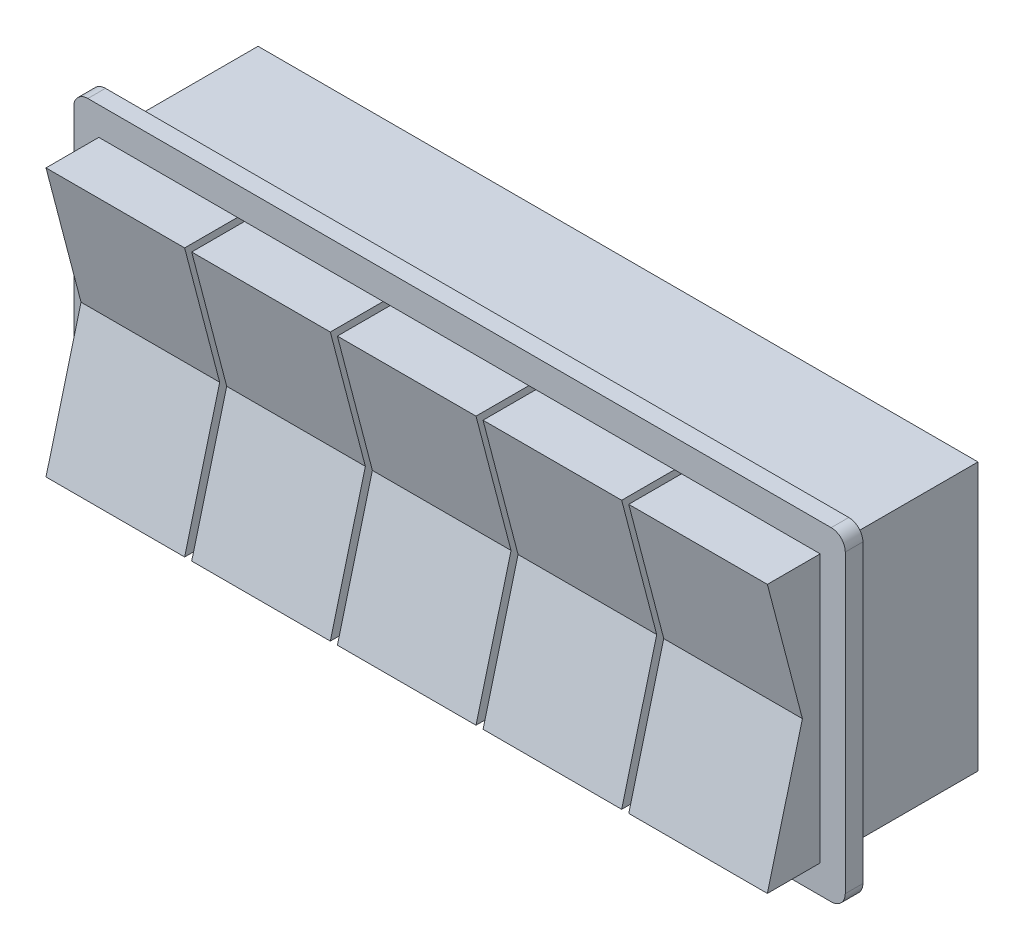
ISO-10303-21;
HEADER;
FILE_DESCRIPTION(('STEP AP214'),'2;1');
FILE_NAME('part.step','',(''),(''),'','','');
FILE_SCHEMA(('AUTOMOTIVE_DESIGN { 1 0 10303 214 1 1 1 1 }'));
ENDSEC;
DATA;
#1=APPLICATION_CONTEXT('core data for automotive mechanical design processes');
#2=APPLICATION_PROTOCOL_DEFINITION('international standard','automotive_design',2000,#1);
#3=PRODUCT_CONTEXT('',#1,'mechanical');
#4=PRODUCT('Part','Part','',(#3));
#5=PRODUCT_RELATED_PRODUCT_CATEGORY('part','',(#4));
#6=PRODUCT_DEFINITION_FORMATION('','',#4);
#7=PRODUCT_DEFINITION_CONTEXT('part definition',#1,'design');
#8=PRODUCT_DEFINITION('design','',#6,#7);
#9=PRODUCT_DEFINITION_SHAPE('','',#8);
#10=(LENGTH_UNIT() NAMED_UNIT(*) SI_UNIT(.MILLI.,.METRE.));
#11=(NAMED_UNIT(*) PLANE_ANGLE_UNIT() SI_UNIT($,.RADIAN.));
#12=(NAMED_UNIT(*) SI_UNIT($,.STERADIAN.) SOLID_ANGLE_UNIT());
#13=UNCERTAINTY_MEASURE_WITH_UNIT(LENGTH_MEASURE(1.E-05),#10,'distance_accuracy_value','');
#14=(GEOMETRIC_REPRESENTATION_CONTEXT(3) GLOBAL_UNCERTAINTY_ASSIGNED_CONTEXT((#13)) GLOBAL_UNIT_ASSIGNED_CONTEXT((#10,
#11,#12)) REPRESENTATION_CONTEXT('',''));
#15=CARTESIAN_POINT('',(0.,0.,0.));
#16=DIRECTION('',(0.,0.,1.));
#17=DIRECTION('',(1.,0.,0.));
#18=AXIS2_PLACEMENT_3D('',#15,#16,#17);
#19=CARTESIAN_POINT('',(-65.024,24.1299999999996,38.1));
#20=DIRECTION('',(0.,-1.,0.));
#21=DIRECTION('',(0.,0.,-1.));
#22=AXIS2_PLACEMENT_3D('',#19,#20,#21);
#23=PLANE('',#22);
#24=DIRECTION('',(-1.,0.,0.));
#25=VECTOR('',#24,1.);
#26=CARTESIAN_POINT('',(-65.024,24.1299999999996,25.4));
#27=LINE('',#26,#25);
#28=CARTESIAN_POINT('',(-40.0304,24.1299999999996,25.4));
#29=VERTEX_POINT('',#28);
#30=CARTESIAN_POINT('',(-65.024,24.1299999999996,25.4));
#31=VERTEX_POINT('',#30);
#32=EDGE_CURVE('E12',#29,#31,#27,.T.);
#33=ORIENTED_EDGE('',*,*,#32,.T.);
#34=DIRECTION('',(0.,0.,-1.));
#35=VECTOR('',#34,1.);
#36=CARTESIAN_POINT('',(-65.024,24.1299999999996,38.1));
#37=LINE('',#36,#35);
#38=CARTESIAN_POINT('',(-65.024,24.1299999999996,38.1));
#39=VERTEX_POINT('',#38);
#40=EDGE_CURVE('E116',#39,#31,#37,.T.);
#41=ORIENTED_EDGE('',*,*,#40,.F.);
#42=DIRECTION('',(-1.,0.,0.));
#43=VECTOR('',#42,1.);
#44=CARTESIAN_POINT('',(-65.024,24.1299999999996,38.1));
#45=LINE('',#44,#43);
#46=CARTESIAN_POINT('',(-40.0304,24.1299999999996,38.1));
#47=VERTEX_POINT('',#46);
#48=EDGE_CURVE('E59',#47,#39,#45,.T.);
#49=ORIENTED_EDGE('',*,*,#48,.F.);
#50=DIRECTION('',(0.,0.,-1.));
#51=VECTOR('',#50,1.);
#52=CARTESIAN_POINT('',(-40.0304,24.1299999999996,38.1));
#53=LINE('',#52,#51);
#54=EDGE_CURVE('E121',#47,#29,#53,.T.);
#55=ORIENTED_EDGE('',*,*,#54,.T.);
#56=EDGE_LOOP('',(#33,#41,#49,#55));
#57=FACE_BOUND('',#56,.T.);
#58=ADVANCED_FACE('F55',(#57),#23,.F.);
#59=CARTESIAN_POINT('',(-65.024,-24.1300000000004,38.1));
#60=DIRECTION('',(1.,0.,0.));
#61=DIRECTION('',(0.,0.,-1.));
#62=AXIS2_PLACEMENT_3D('',#59,#60,#61);
#63=PLANE('',#62);
#64=DIRECTION('',(0.,0.,-1.));
#65=VECTOR('',#64,1.);
#66=CARTESIAN_POINT('',(-65.024,-24.1300000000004,38.1));
#67=LINE('',#66,#65);
#68=CARTESIAN_POINT('',(-65.024,-24.1300000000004,38.1));
#69=VERTEX_POINT('',#68);
#70=CARTESIAN_POINT('',(-65.024,-24.1300000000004,25.4));
#71=VERTEX_POINT('',#70);
#72=EDGE_CURVE('E112',#69,#71,#67,.T.);
#73=ORIENTED_EDGE('',*,*,#72,.F.);
#74=DIRECTION('',(0.,-0.967409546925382,0.253216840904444));
#75=VECTOR('',#74,1.);
#76=CARTESIAN_POINT('',(-65.024,0.,31.7840375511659));
#77=LINE('',#76,#75);
#78=CARTESIAN_POINT('',(-65.024,0.,31.7840375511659));
#79=VERTEX_POINT('',#78);
#80=EDGE_CURVE('E98',#79,#69,#77,.T.);
#81=ORIENTED_EDGE('',*,*,#80,.F.);
#82=DIRECTION('',(0.,-0.96740954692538,-0.253216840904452));
#83=VECTOR('',#82,1.);
#84=CARTESIAN_POINT('',(-65.024,0.,31.7840375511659));
#85=LINE('',#84,#83);
#86=EDGE_CURVE('E109',#39,#79,#85,.T.);
#87=ORIENTED_EDGE('',*,*,#86,.F.);
#88=ORIENTED_EDGE('',*,*,#40,.T.);
#89=DIRECTION('',(0.,-1.,0.));
#90=VECTOR('',#89,1.);
#91=CARTESIAN_POINT('',(-65.024,-24.1300000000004,25.4));
#92=LINE('',#91,#90);
#93=EDGE_CURVE('E65',#31,#71,#92,.T.);
#94=ORIENTED_EDGE('',*,*,#93,.T.);
#95=EDGE_LOOP('',(#73,#81,#87,#88,#94));
#96=FACE_BOUND('',#95,.T.);
#97=ADVANCED_FACE('F113',(#96),#63,.F.);
#98=CARTESIAN_POINT('',(-65.024,-24.1300000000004,38.1));
#99=DIRECTION('',(0.,1.,0.));
#100=DIRECTION('',(0.,0.,1.));
#101=AXIS2_PLACEMENT_3D('',#98,#99,#100);
#102=PLANE('',#101);
#103=DIRECTION('',(1.,0.,0.));
#104=VECTOR('',#103,1.);
#105=CARTESIAN_POINT('',(-65.024,-24.1300000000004,25.4));
#106=LINE('',#105,#104);
#107=CARTESIAN_POINT('',(-40.0304,-24.1300000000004,25.4));
#108=VERTEX_POINT('',#107);
#109=EDGE_CURVE('E127',#71,#108,#106,.T.);
#110=ORIENTED_EDGE('',*,*,#109,.T.);
#111=DIRECTION('',(0.,0.,-1.));
#112=VECTOR('',#111,1.);
#113=CARTESIAN_POINT('',(-40.0304,-24.1300000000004,38.1));
#114=LINE('',#113,#112);
#115=CARTESIAN_POINT('',(-40.0304,-24.1300000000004,38.1));
#116=VERTEX_POINT('',#115);
#117=EDGE_CURVE('E115',#116,#108,#114,.T.);
#118=ORIENTED_EDGE('',*,*,#117,.F.);
#119=DIRECTION('',(1.,0.,0.));
#120=VECTOR('',#119,1.);
#121=CARTESIAN_POINT('',(-65.024,-24.1300000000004,38.1));
#122=LINE('',#121,#120);
#123=EDGE_CURVE('E102',#69,#116,#122,.T.);
#124=ORIENTED_EDGE('',*,*,#123,.F.);
#125=ORIENTED_EDGE('',*,*,#72,.T.);
#126=EDGE_LOOP('',(#110,#118,#124,#125));
#127=FACE_BOUND('',#126,.T.);
#128=ADVANCED_FACE('F119',(#127),#102,.F.);
#129=CARTESIAN_POINT('',(-40.0304,-24.1300000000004,38.1));
#130=DIRECTION('',(-1.,0.,0.));
#131=DIRECTION('',(0.,0.,1.));
#132=AXIS2_PLACEMENT_3D('',#129,#130,#131);
#133=PLANE('',#132);
#134=DIRECTION('',(0.,-0.967409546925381,-0.253216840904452));
#135=VECTOR('',#134,1.);
#136=CARTESIAN_POINT('',(-40.0304,-21.0356282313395,26.2780185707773));
#137=LINE('',#136,#135);
#138=CARTESIAN_POINT('',(-40.0304,0.,31.7840375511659));
#139=VERTEX_POINT('',#138);
#140=EDGE_CURVE('E134',#47,#139,#137,.T.);
#141=ORIENTED_EDGE('',*,*,#140,.T.);
#142=DIRECTION('',(0.,-0.967409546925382,0.253216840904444));
#143=VECTOR('',#142,1.);
#144=CARTESIAN_POINT('',(-40.0304,-24.1300000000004,38.1));
#145=LINE('',#144,#143);
#146=EDGE_CURVE('E132',#139,#116,#145,.T.);
#147=ORIENTED_EDGE('',*,*,#146,.T.);
#148=ORIENTED_EDGE('',*,*,#117,.T.);
#149=DIRECTION('',(0.,1.,0.));
#150=VECTOR('',#149,1.);
#151=CARTESIAN_POINT('',(-40.0304,-24.1300000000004,25.4));
#152=LINE('',#151,#150);
#153=EDGE_CURVE('E122',#108,#29,#152,.T.);
#154=ORIENTED_EDGE('',*,*,#153,.T.);
#155=ORIENTED_EDGE('',*,*,#54,.F.);
#156=EDGE_LOOP('',(#141,#147,#148,#154,#155));
#157=FACE_BOUND('',#156,.T.);
#158=ADVANCED_FACE('F147',(#157),#133,.F.);
#159=CARTESIAN_POINT('',(0.,0.,25.4));
#160=DIRECTION('',(0.,0.,1.));
#161=DIRECTION('',(1.,0.,0.));
#162=AXIS2_PLACEMENT_3D('',#159,#160,#161);
#163=PLANE('',#162);
#164=ORIENTED_EDGE('',*,*,#32,.F.);
#165=ORIENTED_EDGE('',*,*,#153,.F.);
#166=ORIENTED_EDGE('',*,*,#109,.F.);
#167=ORIENTED_EDGE('',*,*,#93,.F.);
#168=EDGE_LOOP('',(#164,#165,#166,#167));
#169=FACE_BOUND('',#168,.T.);
#170=ADVANCED_FACE('F57',(#169),#163,.F.);
#171=CARTESIAN_POINT('',(188.976,0.,31.7840375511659));
#172=DIRECTION('',(0.,-0.253216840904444,-0.967409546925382));
#173=DIRECTION('',(0.,0.967409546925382,-0.253216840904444));
#174=AXIS2_PLACEMENT_3D('',#171,#172,#173);
#175=PLANE('',#174);
#176=DIRECTION('',(-1.,0.,0.));
#177=VECTOR('',#176,1.);
#178=CARTESIAN_POINT('',(188.976,0.,31.7840375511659));
#179=LINE('',#178,#177);
#180=EDGE_CURVE('E105',#139,#79,#179,.T.);
#181=ORIENTED_EDGE('',*,*,#180,.T.);
#182=ORIENTED_EDGE('',*,*,#80,.T.);
#183=ORIENTED_EDGE('',*,*,#123,.T.);
#184=ORIENTED_EDGE('',*,*,#146,.F.);
#185=EDGE_LOOP('',(#181,#182,#183,#184));
#186=FACE_BOUND('',#185,.T.);
#187=ADVANCED_FACE('F100',(#186),#175,.F.);
#188=CARTESIAN_POINT('',(188.976,0.,31.7840375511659));
#189=DIRECTION('',(0.,0.253216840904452,-0.96740954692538));
#190=DIRECTION('',(0.,0.967409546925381,0.253216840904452));
#191=AXIS2_PLACEMENT_3D('',#188,#189,#190);
#192=PLANE('',#191);
#193=ORIENTED_EDGE('',*,*,#48,.T.);
#194=ORIENTED_EDGE('',*,*,#86,.T.);
#195=ORIENTED_EDGE('',*,*,#180,.F.);
#196=ORIENTED_EDGE('',*,*,#140,.F.);
#197=EDGE_LOOP('',(#193,#194,#195,#196));
#198=FACE_BOUND('',#197,.T.);
#199=ADVANCED_FACE('F139',(#198),#192,.F.);
#200=CLOSED_SHELL('',(#58,#97,#128,#158,#170,#187,#199));
#201=MANIFOLD_SOLID_BREP('B2',#200);
#202=CARTESIAN_POINT('',(-38.7604,24.1299999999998,38.1));
#203=DIRECTION('',(0.,-1.,0.));
#204=DIRECTION('',(0.,0.,-1.));
#205=AXIS2_PLACEMENT_3D('',#202,#203,#204);
#206=PLANE('',#205);
#207=DIRECTION('',(-1.,0.,0.));
#208=VECTOR('',#207,1.);
#209=CARTESIAN_POINT('',(-38.7604,24.1299999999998,25.4));
#210=LINE('',#209,#208);
#211=CARTESIAN_POINT('',(-13.7668,24.1299999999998,25.4));
#212=VERTEX_POINT('',#211);
#213=CARTESIAN_POINT('',(-38.7604,24.1299999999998,25.4));
#214=VERTEX_POINT('',#213);
#215=EDGE_CURVE('E53',#212,#214,#210,.T.);
#216=ORIENTED_EDGE('',*,*,#215,.T.);
#217=DIRECTION('',(0.,0.,-1.));
#218=VECTOR('',#217,1.);
#219=CARTESIAN_POINT('',(-38.7604,24.1299999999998,38.1));
#220=LINE('',#219,#218);
#221=CARTESIAN_POINT('',(-38.7604,24.1299999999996,38.1));
#222=VERTEX_POINT('',#221);
#223=EDGE_CURVE('E311',#222,#214,#220,.T.);
#224=ORIENTED_EDGE('',*,*,#223,.F.);
#225=DIRECTION('',(-1.,0.,0.));
#226=VECTOR('',#225,1.);
#227=CARTESIAN_POINT('',(-38.7604,24.1299999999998,38.1));
#228=LINE('',#227,#226);
#229=CARTESIAN_POINT('',(-13.7668,24.1299999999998,38.1));
#230=VERTEX_POINT('',#229);
#231=EDGE_CURVE('E254',#230,#222,#228,.T.);
#232=ORIENTED_EDGE('',*,*,#231,.F.);
#233=DIRECTION('',(0.,0.,-1.));
#234=VECTOR('',#233,1.);
#235=CARTESIAN_POINT('',(-13.7668,24.1299999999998,38.1));
#236=LINE('',#235,#234);
#237=EDGE_CURVE('E325',#230,#212,#236,.T.);
#238=ORIENTED_EDGE('',*,*,#237,.T.);
#239=EDGE_LOOP('',(#216,#224,#232,#238));
#240=FACE_BOUND('',#239,.T.);
#241=ADVANCED_FACE('F250',(#240),#206,.F.);
#242=CARTESIAN_POINT('',(-38.7604,-24.1300000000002,38.1));
#243=DIRECTION('',(1.,0.,0.));
#244=DIRECTION('',(0.,0.,-1.));
#245=AXIS2_PLACEMENT_3D('',#242,#243,#244);
#246=PLANE('',#245);
#247=DIRECTION('',(0.,0.,-1.));
#248=VECTOR('',#247,1.);
#249=CARTESIAN_POINT('',(-38.7604,-24.1300000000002,38.1));
#250=LINE('',#249,#248);
#251=CARTESIAN_POINT('',(-38.7604,-24.1300000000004,38.1));
#252=VERTEX_POINT('',#251);
#253=CARTESIAN_POINT('',(-38.7604,-24.1300000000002,25.4));
#254=VERTEX_POINT('',#253);
#255=EDGE_CURVE('E315',#252,#254,#250,.T.);
#256=ORIENTED_EDGE('',*,*,#255,.F.);
#257=DIRECTION('',(0.,0.967409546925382,-0.253216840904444));
#258=VECTOR('',#257,1.);
#259=CARTESIAN_POINT('',(-38.7604,-24.1300000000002,38.1));
#260=LINE('',#259,#258);
#261=CARTESIAN_POINT('',(-38.7604,0.,31.7840375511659));
#262=VERTEX_POINT('',#261);
#263=EDGE_CURVE('E312',#252,#262,#260,.T.);
#264=ORIENTED_EDGE('',*,*,#263,.T.);
#265=DIRECTION('',(0.,0.967409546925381,0.253216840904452));
#266=VECTOR('',#265,1.);
#267=CARTESIAN_POINT('',(-38.7604,-21.0356282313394,26.2780185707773));
#268=LINE('',#267,#266);
#269=EDGE_CURVE('E297',#262,#222,#268,.T.);
#270=ORIENTED_EDGE('',*,*,#269,.T.);
#271=ORIENTED_EDGE('',*,*,#223,.T.);
#272=DIRECTION('',(0.,-1.,0.));
#273=VECTOR('',#272,1.);
#274=CARTESIAN_POINT('',(-38.7604,-24.1300000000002,25.4));
#275=LINE('',#274,#273);
#276=EDGE_CURVE('E260',#214,#254,#275,.T.);
#277=ORIENTED_EDGE('',*,*,#276,.T.);
#278=EDGE_LOOP('',(#256,#264,#270,#271,#277));
#279=FACE_BOUND('',#278,.T.);
#280=ADVANCED_FACE('F310',(#279),#246,.F.);
#281=CARTESIAN_POINT('',(-38.7604,-24.1300000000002,38.1));
#282=DIRECTION('',(0.,1.,0.));
#283=DIRECTION('',(0.,0.,1.));
#284=AXIS2_PLACEMENT_3D('',#281,#282,#283);
#285=PLANE('',#284);
#286=DIRECTION('',(1.,0.,0.));
#287=VECTOR('',#286,1.);
#288=CARTESIAN_POINT('',(-38.7604,-24.1300000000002,25.4));
#289=LINE('',#288,#287);
#290=CARTESIAN_POINT('',(-13.7668,-24.1300000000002,25.4));
#291=VERTEX_POINT('',#290);
#292=EDGE_CURVE('E328',#254,#291,#289,.T.);
#293=ORIENTED_EDGE('',*,*,#292,.T.);
#294=DIRECTION('',(0.,0.,-1.));
#295=VECTOR('',#294,1.);
#296=CARTESIAN_POINT('',(-13.7668,-24.1300000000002,38.1));
#297=LINE('',#296,#295);
#298=CARTESIAN_POINT('',(-13.7668,-24.1300000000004,38.1));
#299=VERTEX_POINT('',#298);
#300=EDGE_CURVE('E318',#299,#291,#297,.T.);
#301=ORIENTED_EDGE('',*,*,#300,.F.);
#302=DIRECTION('',(1.,0.,0.));
#303=VECTOR('',#302,1.);
#304=CARTESIAN_POINT('',(-38.7604,-24.1300000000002,38.1));
#305=LINE('',#304,#303);
#306=EDGE_CURVE('E306',#252,#299,#305,.T.);
#307=ORIENTED_EDGE('',*,*,#306,.F.);
#308=ORIENTED_EDGE('',*,*,#255,.T.);
#309=EDGE_LOOP('',(#293,#301,#307,#308));
#310=FACE_BOUND('',#309,.T.);
#311=ADVANCED_FACE('F339',(#310),#285,.F.);
#312=CARTESIAN_POINT('',(-13.7668,-24.1300000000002,38.1));
#313=DIRECTION('',(-1.,0.,0.));
#314=DIRECTION('',(0.,0.,1.));
#315=AXIS2_PLACEMENT_3D('',#312,#313,#314);
#316=PLANE('',#315);
#317=DIRECTION('',(0.,-0.967409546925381,-0.253216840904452));
#318=VECTOR('',#317,1.);
#319=CARTESIAN_POINT('',(-13.7668,-21.0356282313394,26.2780185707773));
#320=LINE('',#319,#318);
#321=CARTESIAN_POINT('',(-13.7668,0.,31.7840375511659));
#322=VERTEX_POINT('',#321);
#323=EDGE_CURVE('E300',#230,#322,#320,.T.);
#324=ORIENTED_EDGE('',*,*,#323,.T.);
#325=DIRECTION('',(0.,-0.967409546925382,0.253216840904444));
#326=VECTOR('',#325,1.);
#327=CARTESIAN_POINT('',(-13.7668,-24.1300000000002,38.1));
#328=LINE('',#327,#326);
#329=EDGE_CURVE('E313',#322,#299,#328,.T.);
#330=ORIENTED_EDGE('',*,*,#329,.T.);
#331=ORIENTED_EDGE('',*,*,#300,.T.);
#332=DIRECTION('',(0.,1.,0.));
#333=VECTOR('',#332,1.);
#334=CARTESIAN_POINT('',(-13.7668,-24.1300000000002,25.4));
#335=LINE('',#334,#333);
#336=EDGE_CURVE('E305',#291,#212,#335,.T.);
#337=ORIENTED_EDGE('',*,*,#336,.T.);
#338=ORIENTED_EDGE('',*,*,#237,.F.);
#339=EDGE_LOOP('',(#324,#330,#331,#337,#338));
#340=FACE_BOUND('',#339,.T.);
#341=ADVANCED_FACE('F337',(#340),#316,.F.);
#342=CARTESIAN_POINT('',(0.,0.,25.4));
#343=DIRECTION('',(0.,0.,1.));
#344=DIRECTION('',(1.,0.,0.));
#345=AXIS2_PLACEMENT_3D('',#342,#343,#344);
#346=PLANE('',#345);
#347=ORIENTED_EDGE('',*,*,#215,.F.);
#348=ORIENTED_EDGE('',*,*,#336,.F.);
#349=ORIENTED_EDGE('',*,*,#292,.F.);
#350=ORIENTED_EDGE('',*,*,#276,.F.);
#351=EDGE_LOOP('',(#347,#348,#349,#350));
#352=FACE_BOUND('',#351,.T.);
#353=ADVANCED_FACE('F252',(#352),#346,.F.);
#354=CARTESIAN_POINT('',(188.976,0.,31.7840375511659));
#355=DIRECTION('',(0.,-0.253216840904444,-0.967409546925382));
#356=DIRECTION('',(0.,0.967409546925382,-0.253216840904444));
#357=AXIS2_PLACEMENT_3D('',#354,#355,#356);
#358=PLANE('',#357);
#359=ORIENTED_EDGE('',*,*,#306,.T.);
#360=ORIENTED_EDGE('',*,*,#329,.F.);
#361=DIRECTION('',(-1.,0.,0.));
#362=VECTOR('',#361,1.);
#363=CARTESIAN_POINT('',(188.976,0.,31.7840375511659));
#364=LINE('',#363,#362);
#365=EDGE_CURVE('E396',#322,#262,#364,.T.);
#366=ORIENTED_EDGE('',*,*,#365,.T.);
#367=ORIENTED_EDGE('',*,*,#263,.F.);
#368=EDGE_LOOP('',(#359,#360,#366,#367));
#369=FACE_BOUND('',#368,.T.);
#370=ADVANCED_FACE('F333',(#369),#358,.F.);
#371=CARTESIAN_POINT('',(188.976,0.,31.7840375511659));
#372=DIRECTION('',(0.,0.253216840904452,-0.96740954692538));
#373=DIRECTION('',(0.,0.967409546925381,0.253216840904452));
#374=AXIS2_PLACEMENT_3D('',#371,#372,#373);
#375=PLANE('',#374);
#376=ORIENTED_EDGE('',*,*,#365,.F.);
#377=ORIENTED_EDGE('',*,*,#323,.F.);
#378=ORIENTED_EDGE('',*,*,#231,.T.);
#379=ORIENTED_EDGE('',*,*,#269,.F.);
#380=EDGE_LOOP('',(#376,#377,#378,#379));
#381=FACE_BOUND('',#380,.T.);
#382=ADVANCED_FACE('F296',(#381),#375,.F.);
#383=CLOSED_SHELL('',(#241,#280,#311,#341,#353,#370,#382));
#384=MANIFOLD_SOLID_BREP('B6',#383);
#385=CARTESIAN_POINT('',(40.0304,24.13,38.1));
#386=DIRECTION('',(0.,-1.,0.));
#387=DIRECTION('',(0.,0.,-1.));
#388=AXIS2_PLACEMENT_3D('',#385,#386,#387);
#389=PLANE('',#388);
#390=DIRECTION('',(-1.,0.,0.));
#391=VECTOR('',#390,1.);
#392=CARTESIAN_POINT('',(40.0304,24.13,25.4));
#393=LINE('',#392,#391);
#394=CARTESIAN_POINT('',(65.024,24.13,25.4));
#395=VERTEX_POINT('',#394);
#396=CARTESIAN_POINT('',(40.0304,24.13,25.4));
#397=VERTEX_POINT('',#396);
#398=EDGE_CURVE('E248',#395,#397,#393,.T.);
#399=ORIENTED_EDGE('',*,*,#398,.T.);
#400=DIRECTION('',(0.,0.,-1.));
#401=VECTOR('',#400,1.);
#402=CARTESIAN_POINT('',(40.0304,24.13,38.1));
#403=LINE('',#402,#401);
#404=CARTESIAN_POINT('',(40.0304,24.1299999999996,38.1));
#405=VERTEX_POINT('',#404);
#406=EDGE_CURVE('E470',#405,#397,#403,.T.);
#407=ORIENTED_EDGE('',*,*,#406,.F.);
#408=DIRECTION('',(-1.,0.,0.));
#409=VECTOR('',#408,1.);
#410=CARTESIAN_POINT('',(40.0304,24.13,38.1));
#411=LINE('',#410,#409);
#412=CARTESIAN_POINT('',(65.024,24.13,38.1));
#413=VERTEX_POINT('',#412);
#414=EDGE_CURVE('E413',#413,#405,#411,.T.);
#415=ORIENTED_EDGE('',*,*,#414,.F.);
#416=DIRECTION('',(0.,0.,-1.));
#417=VECTOR('',#416,1.);
#418=CARTESIAN_POINT('',(65.024,24.13,38.1));
#419=LINE('',#418,#417);
#420=EDGE_CURVE('E484',#413,#395,#419,.T.);
#421=ORIENTED_EDGE('',*,*,#420,.T.);
#422=EDGE_LOOP('',(#399,#407,#415,#421));
#423=FACE_BOUND('',#422,.T.);
#424=ADVANCED_FACE('F409',(#423),#389,.F.);
#425=CARTESIAN_POINT('',(40.0304,-24.13,38.1));
#426=DIRECTION('',(1.,0.,0.));
#427=DIRECTION('',(0.,0.,-1.));
#428=AXIS2_PLACEMENT_3D('',#425,#426,#427);
#429=PLANE('',#428);
#430=DIRECTION('',(0.,0.,-1.));
#431=VECTOR('',#430,1.);
#432=CARTESIAN_POINT('',(40.0304,-24.13,38.1));
#433=LINE('',#432,#431);
#434=CARTESIAN_POINT('',(40.0304,-24.1300000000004,38.1));
#435=VERTEX_POINT('',#434);
#436=CARTESIAN_POINT('',(40.0304,-24.13,25.4));
#437=VERTEX_POINT('',#436);
#438=EDGE_CURVE('E474',#435,#437,#433,.T.);
#439=ORIENTED_EDGE('',*,*,#438,.F.);
#440=DIRECTION('',(0.,0.967409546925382,-0.253216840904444));
#441=VECTOR('',#440,1.);
#442=CARTESIAN_POINT('',(40.0304,-24.13,38.0999999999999));
#443=LINE('',#442,#441);
#444=CARTESIAN_POINT('',(40.0304,0.,31.7840375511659));
#445=VERTEX_POINT('',#444);
#446=EDGE_CURVE('E471',#435,#445,#443,.T.);
#447=ORIENTED_EDGE('',*,*,#446,.T.);
#448=DIRECTION('',(0.,0.967409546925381,0.253216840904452));
#449=VECTOR('',#448,1.);
#450=CARTESIAN_POINT('',(40.0304,-21.0356282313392,26.2780185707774));
#451=LINE('',#450,#449);
#452=EDGE_CURVE('E456',#445,#405,#451,.T.);
#453=ORIENTED_EDGE('',*,*,#452,.T.);
#454=ORIENTED_EDGE('',*,*,#406,.T.);
#455=DIRECTION('',(0.,-1.,0.));
#456=VECTOR('',#455,1.);
#457=CARTESIAN_POINT('',(40.0304,-24.13,25.4));
#458=LINE('',#457,#456);
#459=EDGE_CURVE('E419',#397,#437,#458,.T.);
#460=ORIENTED_EDGE('',*,*,#459,.T.);
#461=EDGE_LOOP('',(#439,#447,#453,#454,#460));
#462=FACE_BOUND('',#461,.T.);
#463=ADVANCED_FACE('F469',(#462),#429,.F.);
#464=CARTESIAN_POINT('',(40.0304,-24.13,38.1));
#465=DIRECTION('',(0.,1.,0.));
#466=DIRECTION('',(0.,0.,1.));
#467=AXIS2_PLACEMENT_3D('',#464,#465,#466);
#468=PLANE('',#467);
#469=DIRECTION('',(1.,0.,0.));
#470=VECTOR('',#469,1.);
#471=CARTESIAN_POINT('',(40.0304,-24.13,25.4));
#472=LINE('',#471,#470);
#473=CARTESIAN_POINT('',(65.024,-24.13,25.4));
#474=VERTEX_POINT('',#473);
#475=EDGE_CURVE('E487',#437,#474,#472,.T.);
#476=ORIENTED_EDGE('',*,*,#475,.T.);
#477=DIRECTION('',(0.,0.,-1.));
#478=VECTOR('',#477,1.);
#479=CARTESIAN_POINT('',(65.024,-24.13,38.1));
#480=LINE('',#479,#478);
#481=CARTESIAN_POINT('',(65.024,-24.1300000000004,38.1));
#482=VERTEX_POINT('',#481);
#483=EDGE_CURVE('E477',#482,#474,#480,.T.);
#484=ORIENTED_EDGE('',*,*,#483,.F.);
#485=DIRECTION('',(1.,0.,0.));
#486=VECTOR('',#485,1.);
#487=CARTESIAN_POINT('',(40.0304,-24.13,38.1));
#488=LINE('',#487,#486);
#489=EDGE_CURVE('E465',#435,#482,#488,.T.);
#490=ORIENTED_EDGE('',*,*,#489,.F.);
#491=ORIENTED_EDGE('',*,*,#438,.T.);
#492=EDGE_LOOP('',(#476,#484,#490,#491));
#493=FACE_BOUND('',#492,.T.);
#494=ADVANCED_FACE('F498',(#493),#468,.F.);
#495=CARTESIAN_POINT('',(65.024,-24.13,38.1));
#496=DIRECTION('',(-1.,0.,0.));
#497=DIRECTION('',(0.,0.,1.));
#498=AXIS2_PLACEMENT_3D('',#495,#496,#497);
#499=PLANE('',#498);
#500=DIRECTION('',(0.,-0.967409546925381,-0.253216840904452));
#501=VECTOR('',#500,1.);
#502=CARTESIAN_POINT('',(65.024,-21.0356282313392,26.2780185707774));
#503=LINE('',#502,#501);
#504=CARTESIAN_POINT('',(65.024,0.,31.7840375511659));
#505=VERTEX_POINT('',#504);
#506=EDGE_CURVE('E459',#413,#505,#503,.T.);
#507=ORIENTED_EDGE('',*,*,#506,.T.);
#508=DIRECTION('',(0.,-0.967409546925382,0.253216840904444));
#509=VECTOR('',#508,1.);
#510=CARTESIAN_POINT('',(65.024,-24.13,38.0999999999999));
#511=LINE('',#510,#509);
#512=EDGE_CURVE('E472',#505,#482,#511,.T.);
#513=ORIENTED_EDGE('',*,*,#512,.T.);
#514=ORIENTED_EDGE('',*,*,#483,.T.);
#515=DIRECTION('',(0.,1.,0.));
#516=VECTOR('',#515,1.);
#517=CARTESIAN_POINT('',(65.024,-24.13,25.4));
#518=LINE('',#517,#516);
#519=EDGE_CURVE('E464',#474,#395,#518,.T.);
#520=ORIENTED_EDGE('',*,*,#519,.T.);
#521=ORIENTED_EDGE('',*,*,#420,.F.);
#522=EDGE_LOOP('',(#507,#513,#514,#520,#521));
#523=FACE_BOUND('',#522,.T.);
#524=ADVANCED_FACE('F496',(#523),#499,.F.);
#525=CARTESIAN_POINT('',(0.,0.,25.4));
#526=DIRECTION('',(0.,0.,1.));
#527=DIRECTION('',(1.,0.,0.));
#528=AXIS2_PLACEMENT_3D('',#525,#526,#527);
#529=PLANE('',#528);
#530=ORIENTED_EDGE('',*,*,#398,.F.);
#531=ORIENTED_EDGE('',*,*,#519,.F.);
#532=ORIENTED_EDGE('',*,*,#475,.F.);
#533=ORIENTED_EDGE('',*,*,#459,.F.);
#534=EDGE_LOOP('',(#530,#531,#532,#533));
#535=FACE_BOUND('',#534,.T.);
#536=ADVANCED_FACE('F411',(#535),#529,.F.);
#537=CARTESIAN_POINT('',(188.976,0.,31.7840375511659));
#538=DIRECTION('',(0.,-0.253216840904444,-0.967409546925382));
#539=DIRECTION('',(0.,0.967409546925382,-0.253216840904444));
#540=AXIS2_PLACEMENT_3D('',#537,#538,#539);
#541=PLANE('',#540);
#542=ORIENTED_EDGE('',*,*,#489,.T.);
#543=ORIENTED_EDGE('',*,*,#512,.F.);
#544=DIRECTION('',(-1.,0.,0.));
#545=VECTOR('',#544,1.);
#546=CARTESIAN_POINT('',(188.976,0.,31.7840375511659));
#547=LINE('',#546,#545);
#548=EDGE_CURVE('E555',#505,#445,#547,.T.);
#549=ORIENTED_EDGE('',*,*,#548,.T.);
#550=ORIENTED_EDGE('',*,*,#446,.F.);
#551=EDGE_LOOP('',(#542,#543,#549,#550));
#552=FACE_BOUND('',#551,.T.);
#553=ADVANCED_FACE('F492',(#552),#541,.F.);
#554=CARTESIAN_POINT('',(188.976,0.,31.7840375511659));
#555=DIRECTION('',(0.,0.253216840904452,-0.96740954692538));
#556=DIRECTION('',(0.,0.967409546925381,0.253216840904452));
#557=AXIS2_PLACEMENT_3D('',#554,#555,#556);
#558=PLANE('',#557);
#559=ORIENTED_EDGE('',*,*,#548,.F.);
#560=ORIENTED_EDGE('',*,*,#506,.F.);
#561=ORIENTED_EDGE('',*,*,#414,.T.);
#562=ORIENTED_EDGE('',*,*,#452,.F.);
#563=EDGE_LOOP('',(#559,#560,#561,#562));
#564=FACE_BOUND('',#563,.T.);
#565=ADVANCED_FACE('F455',(#564),#558,.F.);
#566=CLOSED_SHELL('',(#424,#463,#494,#524,#536,#553,#565));
#567=MANIFOLD_SOLID_BREP('B47',#566);
#568=CARTESIAN_POINT('',(13.7668,24.13,38.1));
#569=DIRECTION('',(0.,-1.,0.));
#570=DIRECTION('',(0.,0.,-1.));
#571=AXIS2_PLACEMENT_3D('',#568,#569,#570);
#572=PLANE('',#571);
#573=DIRECTION('',(-1.,0.,0.));
#574=VECTOR('',#573,1.);
#575=CARTESIAN_POINT('',(13.7668,24.13,25.4));
#576=LINE('',#575,#574);
#577=CARTESIAN_POINT('',(38.7604,24.13,25.4));
#578=VERTEX_POINT('',#577);
#579=CARTESIAN_POINT('',(13.7668,24.13,25.4));
#580=VERTEX_POINT('',#579);
#581=EDGE_CURVE('E407',#578,#580,#576,.T.);
#582=ORIENTED_EDGE('',*,*,#581,.T.);
#583=DIRECTION('',(0.,0.,-1.));
#584=VECTOR('',#583,1.);
#585=CARTESIAN_POINT('',(13.7668,24.13,38.1));
#586=LINE('',#585,#584);
#587=CARTESIAN_POINT('',(13.7668,24.1299999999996,38.1));
#588=VERTEX_POINT('',#587);
#589=EDGE_CURVE('E629',#588,#580,#586,.T.);
#590=ORIENTED_EDGE('',*,*,#589,.F.);
#591=DIRECTION('',(-1.,0.,0.));
#592=VECTOR('',#591,1.);
#593=CARTESIAN_POINT('',(13.7668,24.13,38.1));
#594=LINE('',#593,#592);
#595=CARTESIAN_POINT('',(38.7604,24.13,38.1));
#596=VERTEX_POINT('',#595);
#597=EDGE_CURVE('E572',#596,#588,#594,.T.);
#598=ORIENTED_EDGE('',*,*,#597,.F.);
#599=DIRECTION('',(0.,0.,-1.));
#600=VECTOR('',#599,1.);
#601=CARTESIAN_POINT('',(38.7604,24.13,38.1));
#602=LINE('',#601,#600);
#603=EDGE_CURVE('E643',#596,#578,#602,.T.);
#604=ORIENTED_EDGE('',*,*,#603,.T.);
#605=EDGE_LOOP('',(#582,#590,#598,#604));
#606=FACE_BOUND('',#605,.T.);
#607=ADVANCED_FACE('F568',(#606),#572,.F.);
#608=CARTESIAN_POINT('',(13.7668,-24.13,38.1));
#609=DIRECTION('',(1.,0.,0.));
#610=DIRECTION('',(0.,0.,-1.));
#611=AXIS2_PLACEMENT_3D('',#608,#609,#610);
#612=PLANE('',#611);
#613=DIRECTION('',(0.,0.,-1.));
#614=VECTOR('',#613,1.);
#615=CARTESIAN_POINT('',(13.7668,-24.13,38.1));
#616=LINE('',#615,#614);
#617=CARTESIAN_POINT('',(13.7668,-24.1300000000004,38.1));
#618=VERTEX_POINT('',#617);
#619=CARTESIAN_POINT('',(13.7668,-24.13,25.4));
#620=VERTEX_POINT('',#619);
#621=EDGE_CURVE('E633',#618,#620,#616,.T.);
#622=ORIENTED_EDGE('',*,*,#621,.F.);
#623=DIRECTION('',(0.,0.967409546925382,-0.253216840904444));
#624=VECTOR('',#623,1.);
#625=CARTESIAN_POINT('',(13.7668,-24.13,38.0999999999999));
#626=LINE('',#625,#624);
#627=CARTESIAN_POINT('',(13.7668,0.,31.7840375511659));
#628=VERTEX_POINT('',#627);
#629=EDGE_CURVE('E630',#618,#628,#626,.T.);
#630=ORIENTED_EDGE('',*,*,#629,.T.);
#631=DIRECTION('',(0.,0.967409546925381,0.253216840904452));
#632=VECTOR('',#631,1.);
#633=CARTESIAN_POINT('',(13.7668,-21.0356282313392,26.2780185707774));
#634=LINE('',#633,#632);
#635=EDGE_CURVE('E615',#628,#588,#634,.T.);
#636=ORIENTED_EDGE('',*,*,#635,.T.);
#637=ORIENTED_EDGE('',*,*,#589,.T.);
#638=DIRECTION('',(0.,-1.,0.));
#639=VECTOR('',#638,1.);
#640=CARTESIAN_POINT('',(13.7668,-24.13,25.4));
#641=LINE('',#640,#639);
#642=EDGE_CURVE('E578',#580,#620,#641,.T.);
#643=ORIENTED_EDGE('',*,*,#642,.T.);
#644=EDGE_LOOP('',(#622,#630,#636,#637,#643));
#645=FACE_BOUND('',#644,.T.);
#646=ADVANCED_FACE('F628',(#645),#612,.F.);
#647=CARTESIAN_POINT('',(13.7668,-24.13,38.1));
#648=DIRECTION('',(0.,1.,0.));
#649=DIRECTION('',(0.,0.,1.));
#650=AXIS2_PLACEMENT_3D('',#647,#648,#649);
#651=PLANE('',#650);
#652=DIRECTION('',(1.,0.,0.));
#653=VECTOR('',#652,1.);
#654=CARTESIAN_POINT('',(13.7668,-24.13,25.4));
#655=LINE('',#654,#653);
#656=CARTESIAN_POINT('',(38.7604,-24.13,25.4));
#657=VERTEX_POINT('',#656);
#658=EDGE_CURVE('E646',#620,#657,#655,.T.);
#659=ORIENTED_EDGE('',*,*,#658,.T.);
#660=DIRECTION('',(0.,0.,-1.));
#661=VECTOR('',#660,1.);
#662=CARTESIAN_POINT('',(38.7604,-24.13,38.1));
#663=LINE('',#662,#661);
#664=CARTESIAN_POINT('',(38.7604,-24.1300000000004,38.1));
#665=VERTEX_POINT('',#664);
#666=EDGE_CURVE('E636',#665,#657,#663,.T.);
#667=ORIENTED_EDGE('',*,*,#666,.F.);
#668=DIRECTION('',(1.,0.,0.));
#669=VECTOR('',#668,1.);
#670=CARTESIAN_POINT('',(13.7668,-24.13,38.1));
#671=LINE('',#670,#669);
#672=EDGE_CURVE('E624',#618,#665,#671,.T.);
#673=ORIENTED_EDGE('',*,*,#672,.F.);
#674=ORIENTED_EDGE('',*,*,#621,.T.);
#675=EDGE_LOOP('',(#659,#667,#673,#674));
#676=FACE_BOUND('',#675,.T.);
#677=ADVANCED_FACE('F657',(#676),#651,.F.);
#678=CARTESIAN_POINT('',(38.7604,-24.13,38.1));
#679=DIRECTION('',(-1.,0.,0.));
#680=DIRECTION('',(0.,0.,1.));
#681=AXIS2_PLACEMENT_3D('',#678,#679,#680);
#682=PLANE('',#681);
#683=DIRECTION('',(0.,-0.967409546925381,-0.253216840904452));
#684=VECTOR('',#683,1.);
#685=CARTESIAN_POINT('',(38.7604,-21.0356282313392,26.2780185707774));
#686=LINE('',#685,#684);
#687=CARTESIAN_POINT('',(38.7604,0.,31.7840375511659));
#688=VERTEX_POINT('',#687);
#689=EDGE_CURVE('E618',#596,#688,#686,.T.);
#690=ORIENTED_EDGE('',*,*,#689,.T.);
#691=DIRECTION('',(0.,-0.967409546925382,0.253216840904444));
#692=VECTOR('',#691,1.);
#693=CARTESIAN_POINT('',(38.7604,-24.13,38.0999999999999));
#694=LINE('',#693,#692);
#695=EDGE_CURVE('E631',#688,#665,#694,.T.);
#696=ORIENTED_EDGE('',*,*,#695,.T.);
#697=ORIENTED_EDGE('',*,*,#666,.T.);
#698=DIRECTION('',(0.,1.,0.));
#699=VECTOR('',#698,1.);
#700=CARTESIAN_POINT('',(38.7604,-24.13,25.4));
#701=LINE('',#700,#699);
#702=EDGE_CURVE('E623',#657,#578,#701,.T.);
#703=ORIENTED_EDGE('',*,*,#702,.T.);
#704=ORIENTED_EDGE('',*,*,#603,.F.);
#705=EDGE_LOOP('',(#690,#696,#697,#703,#704));
#706=FACE_BOUND('',#705,.T.);
#707=ADVANCED_FACE('F655',(#706),#682,.F.);
#708=CARTESIAN_POINT('',(0.,0.,25.4));
#709=DIRECTION('',(0.,0.,1.));
#710=DIRECTION('',(1.,0.,0.));
#711=AXIS2_PLACEMENT_3D('',#708,#709,#710);
#712=PLANE('',#711);
#713=ORIENTED_EDGE('',*,*,#581,.F.);
#714=ORIENTED_EDGE('',*,*,#702,.F.);
#715=ORIENTED_EDGE('',*,*,#658,.F.);
#716=ORIENTED_EDGE('',*,*,#642,.F.);
#717=EDGE_LOOP('',(#713,#714,#715,#716));
#718=FACE_BOUND('',#717,.T.);
#719=ADVANCED_FACE('F570',(#718),#712,.F.);
#720=CARTESIAN_POINT('',(188.976,0.,31.7840375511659));
#721=DIRECTION('',(0.,-0.253216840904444,-0.967409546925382));
#722=DIRECTION('',(0.,0.967409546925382,-0.253216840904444));
#723=AXIS2_PLACEMENT_3D('',#720,#721,#722);
#724=PLANE('',#723);
#725=ORIENTED_EDGE('',*,*,#672,.T.);
#726=ORIENTED_EDGE('',*,*,#695,.F.);
#727=DIRECTION('',(-1.,0.,0.));
#728=VECTOR('',#727,1.);
#729=CARTESIAN_POINT('',(188.976,0.,31.7840375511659));
#730=LINE('',#729,#728);
#731=EDGE_CURVE('E714',#688,#628,#730,.T.);
#732=ORIENTED_EDGE('',*,*,#731,.T.);
#733=ORIENTED_EDGE('',*,*,#629,.F.);
#734=EDGE_LOOP('',(#725,#726,#732,#733));
#735=FACE_BOUND('',#734,.T.);
#736=ADVANCED_FACE('F651',(#735),#724,.F.);
#737=CARTESIAN_POINT('',(188.976,0.,31.7840375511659));
#738=DIRECTION('',(0.,0.253216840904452,-0.96740954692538));
#739=DIRECTION('',(0.,0.967409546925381,0.253216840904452));
#740=AXIS2_PLACEMENT_3D('',#737,#738,#739);
#741=PLANE('',#740);
#742=ORIENTED_EDGE('',*,*,#731,.F.);
#743=ORIENTED_EDGE('',*,*,#689,.F.);
#744=ORIENTED_EDGE('',*,*,#597,.T.);
#745=ORIENTED_EDGE('',*,*,#635,.F.);
#746=EDGE_LOOP('',(#742,#743,#744,#745));
#747=FACE_BOUND('',#746,.T.);
#748=ADVANCED_FACE('F614',(#747),#741,.F.);
#749=CLOSED_SHELL('',(#607,#646,#677,#707,#719,#736,#748));
#750=MANIFOLD_SOLID_BREP('B242',#749);
#751=CARTESIAN_POINT('',(12.4968,-24.13,38.1));
#752=DIRECTION('',(-1.,0.,0.));
#753=DIRECTION('',(0.,0.,1.));
#754=AXIS2_PLACEMENT_3D('',#751,#752,#753);
#755=PLANE('',#754);
#756=DIRECTION('',(0.,-0.967409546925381,-0.253216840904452));
#757=VECTOR('',#756,1.);
#758=CARTESIAN_POINT('',(12.4968,-21.0356282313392,26.2780185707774));
#759=LINE('',#758,#757);
#760=CARTESIAN_POINT('',(12.4968,24.13,38.1));
#761=VERTEX_POINT('',#760);
#762=CARTESIAN_POINT('',(12.4968,0.,31.7840375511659));
#763=VERTEX_POINT('',#762);
#764=EDGE_CURVE('E742',#761,#763,#759,.T.);
#765=ORIENTED_EDGE('',*,*,#764,.T.);
#766=DIRECTION('',(0.,-0.967409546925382,0.253216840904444));
#767=VECTOR('',#766,1.);
#768=CARTESIAN_POINT('',(12.4968,-24.13,38.0999999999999));
#769=LINE('',#768,#767);
#770=CARTESIAN_POINT('',(12.4968,-24.1300000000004,38.1));
#771=VERTEX_POINT('',#770);
#772=EDGE_CURVE('E799',#763,#771,#769,.T.);
#773=ORIENTED_EDGE('',*,*,#772,.T.);
#774=DIRECTION('',(0.,0.,-1.));
#775=VECTOR('',#774,1.);
#776=CARTESIAN_POINT('',(12.4968,-24.13,38.1));
#777=LINE('',#776,#775);
#778=CARTESIAN_POINT('',(12.4968,-24.13,25.4));
#779=VERTEX_POINT('',#778);
#780=EDGE_CURVE('E779',#771,#779,#777,.T.);
#781=ORIENTED_EDGE('',*,*,#780,.T.);
#782=DIRECTION('',(0.,1.,0.));
#783=VECTOR('',#782,1.);
#784=CARTESIAN_POINT('',(12.4968,-24.13,25.4));
#785=LINE('',#784,#783);
#786=CARTESIAN_POINT('',(12.4968,24.13,25.4));
#787=VERTEX_POINT('',#786);
#788=EDGE_CURVE('E784',#779,#787,#785,.T.);
#789=ORIENTED_EDGE('',*,*,#788,.T.);
#790=DIRECTION('',(0.,0.,-1.));
#791=VECTOR('',#790,1.);
#792=CARTESIAN_POINT('',(12.4968,24.13,38.1));
#793=LINE('',#792,#791);
#794=EDGE_CURVE('E566',#761,#787,#793,.T.);
#795=ORIENTED_EDGE('',*,*,#794,.F.);
#796=EDGE_LOOP('',(#765,#773,#781,#789,#795));
#797=FACE_BOUND('',#796,.T.);
#798=ADVANCED_FACE('F727',(#797),#755,.F.);
#799=CARTESIAN_POINT('',(-12.4968,24.13,38.1));
#800=DIRECTION('',(0.,-1.,0.));
#801=DIRECTION('',(0.,0.,-1.));
#802=AXIS2_PLACEMENT_3D('',#799,#800,#801);
#803=PLANE('',#802);
#804=DIRECTION('',(-1.,0.,0.));
#805=VECTOR('',#804,1.);
#806=CARTESIAN_POINT('',(-12.4968,24.13,25.4));
#807=LINE('',#806,#805);
#808=CARTESIAN_POINT('',(-12.4968,24.13,25.4));
#809=VERTEX_POINT('',#808);
#810=EDGE_CURVE('E771',#787,#809,#807,.T.);
#811=ORIENTED_EDGE('',*,*,#810,.T.);
#812=DIRECTION('',(0.,0.,-1.));
#813=VECTOR('',#812,1.);
#814=CARTESIAN_POINT('',(-12.4968,24.13,38.1));
#815=LINE('',#814,#813);
#816=CARTESIAN_POINT('',(-12.4968,24.1299999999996,38.1));
#817=VERTEX_POINT('',#816);
#818=EDGE_CURVE('E735',#817,#809,#815,.T.);
#819=ORIENTED_EDGE('',*,*,#818,.F.);
#820=DIRECTION('',(-1.,0.,0.));
#821=VECTOR('',#820,1.);
#822=CARTESIAN_POINT('',(-12.4968,24.13,38.1));
#823=LINE('',#822,#821);
#824=EDGE_CURVE('E785',#761,#817,#823,.T.);
#825=ORIENTED_EDGE('',*,*,#824,.F.);
#826=ORIENTED_EDGE('',*,*,#794,.T.);
#827=EDGE_LOOP('',(#811,#819,#825,#826));
#828=FACE_BOUND('',#827,.T.);
#829=ADVANCED_FACE('F801',(#828),#803,.F.);
#830=CARTESIAN_POINT('',(-12.4968,-24.13,38.1));
#831=DIRECTION('',(1.,0.,0.));
#832=DIRECTION('',(0.,0.,-1.));
#833=AXIS2_PLACEMENT_3D('',#830,#831,#832);
#834=PLANE('',#833);
#835=DIRECTION('',(0.,0.,-1.));
#836=VECTOR('',#835,1.);
#837=CARTESIAN_POINT('',(-12.4968,-24.13,38.1));
#838=LINE('',#837,#836);
#839=CARTESIAN_POINT('',(-12.4968,-24.1300000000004,38.1));
#840=VERTEX_POINT('',#839);
#841=CARTESIAN_POINT('',(-12.4968,-24.13,25.4));
#842=VERTEX_POINT('',#841);
#843=EDGE_CURVE('E764',#840,#842,#838,.T.);
#844=ORIENTED_EDGE('',*,*,#843,.F.);
#845=DIRECTION('',(0.,0.967409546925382,-0.253216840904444));
#846=VECTOR('',#845,1.);
#847=CARTESIAN_POINT('',(-12.4968,-24.13,38.0999999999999));
#848=LINE('',#847,#846);
#849=CARTESIAN_POINT('',(-12.4968,0.,31.7840375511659));
#850=VERTEX_POINT('',#849);
#851=EDGE_CURVE('E830',#840,#850,#848,.T.);
#852=ORIENTED_EDGE('',*,*,#851,.T.);
#853=DIRECTION('',(0.,0.967409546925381,0.253216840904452));
#854=VECTOR('',#853,1.);
#855=CARTESIAN_POINT('',(-12.4968,-21.0356282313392,26.2780185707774));
#856=LINE('',#855,#854);
#857=EDGE_CURVE('E827',#850,#817,#856,.T.);
#858=ORIENTED_EDGE('',*,*,#857,.T.);
#859=ORIENTED_EDGE('',*,*,#818,.T.);
#860=DIRECTION('',(0.,-1.,0.));
#861=VECTOR('',#860,1.);
#862=CARTESIAN_POINT('',(-12.4968,-24.13,25.4));
#863=LINE('',#862,#861);
#864=EDGE_CURVE('E760',#809,#842,#863,.T.);
#865=ORIENTED_EDGE('',*,*,#864,.T.);
#866=EDGE_LOOP('',(#844,#852,#858,#859,#865));
#867=FACE_BOUND('',#866,.T.);
#868=ADVANCED_FACE('F762',(#867),#834,.F.);
#869=CARTESIAN_POINT('',(-12.4968,-24.13,38.1));
#870=DIRECTION('',(0.,1.,0.));
#871=DIRECTION('',(0.,0.,1.));
#872=AXIS2_PLACEMENT_3D('',#869,#870,#871);
#873=PLANE('',#872);
#874=DIRECTION('',(1.,0.,0.));
#875=VECTOR('',#874,1.);
#876=CARTESIAN_POINT('',(-12.4968,-24.13,25.4));
#877=LINE('',#876,#875);
#878=EDGE_CURVE('E770',#842,#779,#877,.T.);
#879=ORIENTED_EDGE('',*,*,#878,.T.);
#880=ORIENTED_EDGE('',*,*,#780,.F.);
#881=DIRECTION('',(1.,0.,0.));
#882=VECTOR('',#881,1.);
#883=CARTESIAN_POINT('',(-12.4968,-24.13,38.1));
#884=LINE('',#883,#882);
#885=EDGE_CURVE('E778',#840,#771,#884,.T.);
#886=ORIENTED_EDGE('',*,*,#885,.F.);
#887=ORIENTED_EDGE('',*,*,#843,.T.);
#888=EDGE_LOOP('',(#879,#880,#886,#887));
#889=FACE_BOUND('',#888,.T.);
#890=ADVANCED_FACE('F774',(#889),#873,.F.);
#891=CARTESIAN_POINT('',(0.,0.,25.4));
#892=DIRECTION('',(0.,0.,-1.));
#893=DIRECTION('',(-1.,0.,0.));
#894=AXIS2_PLACEMENT_3D('',#891,#892,#893);
#895=PLANE('',#894);
#896=ORIENTED_EDGE('',*,*,#788,.F.);
#897=ORIENTED_EDGE('',*,*,#878,.F.);
#898=ORIENTED_EDGE('',*,*,#864,.F.);
#899=ORIENTED_EDGE('',*,*,#810,.F.);
#900=EDGE_LOOP('',(#896,#897,#898,#899));
#901=FACE_BOUND('',#900,.T.);
#902=ADVANCED_FACE('F782',(#901),#895,.T.);
#903=CARTESIAN_POINT('',(188.976,0.,31.7840375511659));
#904=DIRECTION('',(0.,-0.253216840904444,-0.967409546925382));
#905=DIRECTION('',(0.,0.967409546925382,-0.253216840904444));
#906=AXIS2_PLACEMENT_3D('',#903,#904,#905);
#907=PLANE('',#906);
#908=DIRECTION('',(-1.,0.,0.));
#909=VECTOR('',#908,1.);
#910=CARTESIAN_POINT('',(188.976,0.,31.7840375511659));
#911=LINE('',#910,#909);
#912=EDGE_CURVE('E831',#763,#850,#911,.T.);
#913=ORIENTED_EDGE('',*,*,#912,.T.);
#914=ORIENTED_EDGE('',*,*,#851,.F.);
#915=ORIENTED_EDGE('',*,*,#885,.T.);
#916=ORIENTED_EDGE('',*,*,#772,.F.);
#917=EDGE_LOOP('',(#913,#914,#915,#916));
#918=FACE_BOUND('',#917,.T.);
#919=ADVANCED_FACE('F818',(#918),#907,.F.);
#920=CARTESIAN_POINT('',(188.976,0.,31.7840375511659));
#921=DIRECTION('',(0.,0.253216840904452,-0.96740954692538));
#922=DIRECTION('',(0.,0.967409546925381,0.253216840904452));
#923=AXIS2_PLACEMENT_3D('',#920,#921,#922);
#924=PLANE('',#923);
#925=ORIENTED_EDGE('',*,*,#824,.T.);
#926=ORIENTED_EDGE('',*,*,#857,.F.);
#927=ORIENTED_EDGE('',*,*,#912,.F.);
#928=ORIENTED_EDGE('',*,*,#764,.F.);
#929=EDGE_LOOP('',(#925,#926,#927,#928));
#930=FACE_BOUND('',#929,.T.);
#931=ADVANCED_FACE('F821',(#930),#924,.F.);
#932=CLOSED_SHELL('',(#798,#829,#868,#890,#902,#919,#931));
#933=MANIFOLD_SOLID_BREP('B401',#932);
#934=CARTESIAN_POINT('',(-67.0052,-26.67,28.575));
#935=DIRECTION('',(0.,0.,-1.));
#936=DIRECTION('',(-1.,0.,0.));
#937=AXIS2_PLACEMENT_3D('',#934,#935,#936);
#938=PLANE('',#937);
#939=CARTESIAN_POINT('',(-67.0052,-26.67,28.575));
#940=DIRECTION('',(0.,0.,1.));
#941=DIRECTION('',(-1.,0.,0.));
#942=AXIS2_PLACEMENT_3D('',#939,#940,#941);
#943=CIRCLE('',#942,2.54);
#944=CARTESIAN_POINT('',(-69.5452,-26.67,28.575));
#945=VERTEX_POINT('',#944);
#946=CARTESIAN_POINT('',(-67.0052,-29.21,28.575));
#947=VERTEX_POINT('',#946);
#948=EDGE_CURVE('E1010',#945,#947,#943,.T.);
#949=ORIENTED_EDGE('',*,*,#948,.T.);
#950=DIRECTION('',(1.,0.,0.));
#951=VECTOR('',#950,1.);
#952=CARTESIAN_POINT('',(-67.0052,-29.21,28.575));
#953=LINE('',#952,#951);
#954=CARTESIAN_POINT('',(67.0052,-29.21,28.575));
#955=VERTEX_POINT('',#954);
#956=EDGE_CURVE('E1013',#947,#955,#953,.T.);
#957=ORIENTED_EDGE('',*,*,#956,.T.);
#958=CARTESIAN_POINT('',(67.0052,-26.67,28.575));
#959=DIRECTION('',(0.,0.,1.));
#960=DIRECTION('',(1.,0.,0.));
#961=AXIS2_PLACEMENT_3D('',#958,#959,#960);
#962=CIRCLE('',#961,2.54);
#963=CARTESIAN_POINT('',(69.5452,-26.67,28.575));
#964=VERTEX_POINT('',#963);
#965=EDGE_CURVE('E1016',#955,#964,#962,.T.);
#966=ORIENTED_EDGE('',*,*,#965,.T.);
#967=DIRECTION('',(0.,1.,0.));
#968=VECTOR('',#967,1.);
#969=CARTESIAN_POINT('',(69.5452,-26.67,28.575));
#970=LINE('',#969,#968);
#971=CARTESIAN_POINT('',(69.5452,26.67,28.575));
#972=VERTEX_POINT('',#971);
#973=EDGE_CURVE('E1018',#964,#972,#970,.T.);
#974=ORIENTED_EDGE('',*,*,#973,.T.);
#975=CARTESIAN_POINT('',(67.0052,26.67,28.575));
#976=DIRECTION('',(0.,0.,1.));
#977=DIRECTION('',(-1.,0.,0.));
#978=AXIS2_PLACEMENT_3D('',#975,#976,#977);
#979=CIRCLE('',#978,2.54);
#980=CARTESIAN_POINT('',(67.0052,29.21,28.575));
#981=VERTEX_POINT('',#980);
#982=EDGE_CURVE('E1020',#972,#981,#979,.T.);
#983=ORIENTED_EDGE('',*,*,#982,.T.);
#984=DIRECTION('',(-1.,0.,0.));
#985=VECTOR('',#984,1.);
#986=CARTESIAN_POINT('',(-67.0052,29.21,28.575));
#987=LINE('',#986,#985);
#988=CARTESIAN_POINT('',(-67.0052,29.21,28.575));
#989=VERTEX_POINT('',#988);
#990=EDGE_CURVE('E1022',#981,#989,#987,.T.);
#991=ORIENTED_EDGE('',*,*,#990,.T.);
#992=CARTESIAN_POINT('',(-67.0052,26.67,28.575));
#993=DIRECTION('',(0.,0.,1.));
#994=DIRECTION('',(1.,0.,0.));
#995=AXIS2_PLACEMENT_3D('',#992,#993,#994);
#996=CIRCLE('',#995,2.54);
#997=CARTESIAN_POINT('',(-69.5452,26.67,28.575));
#998=VERTEX_POINT('',#997);
#999=EDGE_CURVE('E1024',#989,#998,#996,.T.);
#1000=ORIENTED_EDGE('',*,*,#999,.T.);
#1001=DIRECTION('',(0.,-1.,0.));
#1002=VECTOR('',#1001,1.);
#1003=CARTESIAN_POINT('',(-69.5452,-26.67,28.575));
#1004=LINE('',#1003,#1002);
#1005=EDGE_CURVE('E1026',#998,#945,#1004,.T.);
#1006=ORIENTED_EDGE('',*,*,#1005,.T.);
#1007=EDGE_LOOP('',(#949,#957,#966,#974,#983,#991,#1000,#1006));
#1008=FACE_BOUND('',#1007,.T.);
#1009=DIRECTION('',(0.,-1.,0.));
#1010=VECTOR('',#1009,1.);
#1011=CARTESIAN_POINT('',(-64.897,24.13,28.575));
#1012=LINE('',#1011,#1010);
#1013=CARTESIAN_POINT('',(-64.897,24.13,28.575));
#1014=VERTEX_POINT('',#1013);
#1015=CARTESIAN_POINT('',(-64.897,-24.13,28.575));
#1016=VERTEX_POINT('',#1015);
#1017=EDGE_CURVE('E974',#1014,#1016,#1012,.T.);
#1018=ORIENTED_EDGE('',*,*,#1017,.F.);
#1019=DIRECTION('',(-1.,0.,0.));
#1020=VECTOR('',#1019,1.);
#1021=CARTESIAN_POINT('',(-64.897,24.13,28.575));
#1022=LINE('',#1021,#1020);
#1023=CARTESIAN_POINT('',(64.897,24.13,28.575));
#1024=VERTEX_POINT('',#1023);
#1025=EDGE_CURVE('E996',#1024,#1014,#1022,.T.);
#1026=ORIENTED_EDGE('',*,*,#1025,.F.);
#1027=DIRECTION('',(0.,1.,0.));
#1028=VECTOR('',#1027,1.);
#1029=CARTESIAN_POINT('',(64.897,24.13,28.575));
#1030=LINE('',#1029,#1028);
#1031=CARTESIAN_POINT('',(64.897,-24.13,28.575));
#1032=VERTEX_POINT('',#1031);
#1033=EDGE_CURVE('E994',#1032,#1024,#1030,.T.);
#1034=ORIENTED_EDGE('',*,*,#1033,.F.);
#1035=DIRECTION('',(1.,0.,0.));
#1036=VECTOR('',#1035,1.);
#1037=CARTESIAN_POINT('',(-64.897,-24.13,28.575));
#1038=LINE('',#1037,#1036);
#1039=EDGE_CURVE('E982',#1016,#1032,#1038,.T.);
#1040=ORIENTED_EDGE('',*,*,#1039,.F.);
#1041=EDGE_LOOP('',(#1018,#1026,#1034,#1040));
#1042=FACE_BOUND('',#1041,.T.);
#1043=ADVANCED_FACE('F885',(#1008,#1042),#938,.F.);
#1044=CARTESIAN_POINT('',(-67.0052,-26.67,25.4));
#1045=DIRECTION('',(0.,0.,-1.));
#1046=DIRECTION('',(-1.,0.,0.));
#1047=AXIS2_PLACEMENT_3D('',#1044,#1045,#1046);
#1048=PLANE('',#1047);
#1049=CARTESIAN_POINT('',(-67.0052,-26.67,25.4));
#1050=DIRECTION('',(0.,0.,1.));
#1051=DIRECTION('',(-1.,0.,0.));
#1052=AXIS2_PLACEMENT_3D('',#1049,#1050,#1051);
#1053=CIRCLE('',#1052,2.54);
#1054=CARTESIAN_POINT('',(-69.5452,-26.67,25.4));
#1055=VERTEX_POINT('',#1054);
#1056=CARTESIAN_POINT('',(-67.0052,-29.21,25.4));
#1057=VERTEX_POINT('',#1056);
#1058=EDGE_CURVE('E990',#1055,#1057,#1053,.T.);
#1059=ORIENTED_EDGE('',*,*,#1058,.F.);
#1060=DIRECTION('',(0.,-1.,0.));
#1061=VECTOR('',#1060,1.);
#1062=CARTESIAN_POINT('',(-69.5452,-26.67,25.4));
#1063=LINE('',#1062,#1061);
#1064=CARTESIAN_POINT('',(-69.5452,26.67,25.4));
#1065=VERTEX_POINT('',#1064);
#1066=EDGE_CURVE('E1014',#1065,#1055,#1063,.T.);
#1067=ORIENTED_EDGE('',*,*,#1066,.F.);
#1068=CARTESIAN_POINT('',(-67.0052,26.67,25.4));
#1069=DIRECTION('',(0.,0.,1.));
#1070=DIRECTION('',(1.,0.,0.));
#1071=AXIS2_PLACEMENT_3D('',#1068,#1069,#1070);
#1072=CIRCLE('',#1071,2.54);
#1073=CARTESIAN_POINT('',(-67.0052,29.21,25.4));
#1074=VERTEX_POINT('',#1073);
#1075=EDGE_CURVE('E1041',#1074,#1065,#1072,.T.);
#1076=ORIENTED_EDGE('',*,*,#1075,.F.);
#1077=DIRECTION('',(-1.,0.,0.));
#1078=VECTOR('',#1077,1.);
#1079=CARTESIAN_POINT('',(-67.0052,29.21,25.4));
#1080=LINE('',#1079,#1078);
#1081=CARTESIAN_POINT('',(67.0052,29.21,25.4));
#1082=VERTEX_POINT('',#1081);
#1083=EDGE_CURVE('E1039',#1082,#1074,#1080,.T.);
#1084=ORIENTED_EDGE('',*,*,#1083,.F.);
#1085=CARTESIAN_POINT('',(67.0052,26.67,25.4));
#1086=DIRECTION('',(0.,0.,1.));
#1087=DIRECTION('',(-1.,0.,0.));
#1088=AXIS2_PLACEMENT_3D('',#1085,#1086,#1087);
#1089=CIRCLE('',#1088,2.54);
#1090=CARTESIAN_POINT('',(69.5452,26.67,25.4));
#1091=VERTEX_POINT('',#1090);
#1092=EDGE_CURVE('E1037',#1091,#1082,#1089,.T.);
#1093=ORIENTED_EDGE('',*,*,#1092,.F.);
#1094=DIRECTION('',(0.,1.,0.));
#1095=VECTOR('',#1094,1.);
#1096=CARTESIAN_POINT('',(69.5452,-26.67,25.4));
#1097=LINE('',#1096,#1095);
#1098=CARTESIAN_POINT('',(69.5452,-26.67,25.4));
#1099=VERTEX_POINT('',#1098);
#1100=EDGE_CURVE('E1035',#1099,#1091,#1097,.T.);
#1101=ORIENTED_EDGE('',*,*,#1100,.F.);
#1102=CARTESIAN_POINT('',(67.0052,-26.67,25.4));
#1103=DIRECTION('',(0.,0.,1.));
#1104=DIRECTION('',(1.,0.,0.));
#1105=AXIS2_PLACEMENT_3D('',#1102,#1103,#1104);
#1106=CIRCLE('',#1105,2.54);
#1107=CARTESIAN_POINT('',(67.0052,-29.21,25.4));
#1108=VERTEX_POINT('',#1107);
#1109=EDGE_CURVE('E1033',#1108,#1099,#1106,.T.);
#1110=ORIENTED_EDGE('',*,*,#1109,.F.);
#1111=DIRECTION('',(1.,0.,0.));
#1112=VECTOR('',#1111,1.);
#1113=CARTESIAN_POINT('',(-67.0052,-29.21,25.4));
#1114=LINE('',#1113,#1112);
#1115=EDGE_CURVE('E1031',#1057,#1108,#1114,.T.);
#1116=ORIENTED_EDGE('',*,*,#1115,.F.);
#1117=EDGE_LOOP('',(#1059,#1067,#1076,#1084,#1093,#1101,#1110,#1116));
#1118=FACE_BOUND('',#1117,.T.);
#1119=DIRECTION('',(-1.,0.,0.));
#1120=VECTOR('',#1119,1.);
#1121=CARTESIAN_POINT('',(-64.897,24.13,25.4));
#1122=LINE('',#1121,#1120);
#1123=CARTESIAN_POINT('',(64.897,24.13,25.4));
#1124=VERTEX_POINT('',#1123);
#1125=CARTESIAN_POINT('',(-64.897,24.13,25.4));
#1126=VERTEX_POINT('',#1125);
#1127=EDGE_CURVE('E983',#1124,#1126,#1122,.T.);
#1128=ORIENTED_EDGE('',*,*,#1127,.T.);
#1129=DIRECTION('',(0.,-1.,0.));
#1130=VECTOR('',#1129,1.);
#1131=CARTESIAN_POINT('',(-64.897,24.13,25.4));
#1132=LINE('',#1131,#1130);
#1133=CARTESIAN_POINT('',(-64.897,-24.13,25.4));
#1134=VERTEX_POINT('',#1133);
#1135=EDGE_CURVE('E908',#1126,#1134,#1132,.T.);
#1136=ORIENTED_EDGE('',*,*,#1135,.T.);
#1137=DIRECTION('',(1.,0.,0.));
#1138=VECTOR('',#1137,1.);
#1139=CARTESIAN_POINT('',(-64.897,-24.13,25.4));
#1140=LINE('',#1139,#1138);
#1141=CARTESIAN_POINT('',(64.897,-24.13,25.4));
#1142=VERTEX_POINT('',#1141);
#1143=EDGE_CURVE('E989',#1134,#1142,#1140,.T.);
#1144=ORIENTED_EDGE('',*,*,#1143,.T.);
#1145=DIRECTION('',(0.,1.,0.));
#1146=VECTOR('',#1145,1.);
#1147=CARTESIAN_POINT('',(64.897,24.13,25.4));
#1148=LINE('',#1147,#1146);
#1149=EDGE_CURVE('E1002',#1142,#1124,#1148,.T.);
#1150=ORIENTED_EDGE('',*,*,#1149,.T.);
#1151=EDGE_LOOP('',(#1128,#1136,#1144,#1150));
#1152=FACE_BOUND('',#1151,.T.);
#1153=ADVANCED_FACE('F1071',(#1118,#1152),#1048,.T.);
#1154=CARTESIAN_POINT('',(-67.0052,-26.67,28.575));
#1155=DIRECTION('',(0.,0.,-1.));
#1156=DIRECTION('',(-1.,0.,0.));
#1157=AXIS2_PLACEMENT_3D('',#1154,#1155,#1156);
#1158=CYLINDRICAL_SURFACE('',#1157,2.54);
#1159=ORIENTED_EDGE('',*,*,#1058,.T.);
#1160=DIRECTION('',(0.,0.,-1.));
#1161=VECTOR('',#1160,1.);
#1162=CARTESIAN_POINT('',(-67.0052,-29.21,28.575));
#1163=LINE('',#1162,#1161);
#1164=EDGE_CURVE('E725',#947,#1057,#1163,.T.);
#1165=ORIENTED_EDGE('',*,*,#1164,.F.);
#1166=ORIENTED_EDGE('',*,*,#948,.F.);
#1167=DIRECTION('',(0.,0.,-1.));
#1168=VECTOR('',#1167,1.);
#1169=CARTESIAN_POINT('',(-69.5452,-26.67,28.575));
#1170=LINE('',#1169,#1168);
#1171=EDGE_CURVE('E1028',#945,#1055,#1170,.T.);
#1172=ORIENTED_EDGE('',*,*,#1171,.T.);
#1173=EDGE_LOOP('',(#1159,#1165,#1166,#1172));
#1174=FACE_BOUND('',#1173,.T.);
#1175=ADVANCED_FACE('F887',(#1174),#1158,.T.);
#1176=CARTESIAN_POINT('',(-67.0052,-29.21,28.575));
#1177=DIRECTION('',(0.,1.,0.));
#1178=DIRECTION('',(0.,0.,1.));
#1179=AXIS2_PLACEMENT_3D('',#1176,#1177,#1178);
#1180=PLANE('',#1179);
#1181=ORIENTED_EDGE('',*,*,#1115,.T.);
#1182=DIRECTION('',(0.,0.,-1.));
#1183=VECTOR('',#1182,1.);
#1184=CARTESIAN_POINT('',(67.0052,-29.21,28.575));
#1185=LINE('',#1184,#1183);
#1186=EDGE_CURVE('E893',#955,#1108,#1185,.T.);
#1187=ORIENTED_EDGE('',*,*,#1186,.F.);
#1188=ORIENTED_EDGE('',*,*,#956,.F.);
#1189=ORIENTED_EDGE('',*,*,#1164,.T.);
#1190=EDGE_LOOP('',(#1181,#1187,#1188,#1189));
#1191=FACE_BOUND('',#1190,.T.);
#1192=ADVANCED_FACE('F1088',(#1191),#1180,.F.);
#1193=CARTESIAN_POINT('',(67.0052,-26.67,28.575));
#1194=DIRECTION('',(0.,0.,-1.));
#1195=DIRECTION('',(-1.,0.,0.));
#1196=AXIS2_PLACEMENT_3D('',#1193,#1194,#1195);
#1197=CYLINDRICAL_SURFACE('',#1196,2.54);
#1198=ORIENTED_EDGE('',*,*,#1109,.T.);
#1199=DIRECTION('',(0.,0.,-1.));
#1200=VECTOR('',#1199,1.);
#1201=CARTESIAN_POINT('',(69.5452,-26.67,28.575));
#1202=LINE('',#1201,#1200);
#1203=EDGE_CURVE('E1058',#964,#1099,#1202,.T.);
#1204=ORIENTED_EDGE('',*,*,#1203,.F.);
#1205=ORIENTED_EDGE('',*,*,#965,.F.);
#1206=ORIENTED_EDGE('',*,*,#1186,.T.);
#1207=EDGE_LOOP('',(#1198,#1204,#1205,#1206));
#1208=FACE_BOUND('',#1207,.T.);
#1209=ADVANCED_FACE('F1065',(#1208),#1197,.T.);
#1210=CARTESIAN_POINT('',(69.5452,-26.67,28.575));
#1211=DIRECTION('',(-1.,0.,0.));
#1212=DIRECTION('',(0.,0.,1.));
#1213=AXIS2_PLACEMENT_3D('',#1210,#1211,#1212);
#1214=PLANE('',#1213);
#1215=ORIENTED_EDGE('',*,*,#1100,.T.);
#1216=DIRECTION('',(0.,0.,-1.));
#1217=VECTOR('',#1216,1.);
#1218=CARTESIAN_POINT('',(69.5452,26.67,28.575));
#1219=LINE('',#1218,#1217);
#1220=EDGE_CURVE('E1055',#972,#1091,#1219,.T.);
#1221=ORIENTED_EDGE('',*,*,#1220,.F.);
#1222=ORIENTED_EDGE('',*,*,#973,.F.);
#1223=ORIENTED_EDGE('',*,*,#1203,.T.);
#1224=EDGE_LOOP('',(#1215,#1221,#1222,#1223));
#1225=FACE_BOUND('',#1224,.T.);
#1226=ADVANCED_FACE('F1077',(#1225),#1214,.F.);
#1227=CARTESIAN_POINT('',(67.0052,26.67,28.575));
#1228=DIRECTION('',(0.,0.,-1.));
#1229=DIRECTION('',(-1.,0.,0.));
#1230=AXIS2_PLACEMENT_3D('',#1227,#1228,#1229);
#1231=CYLINDRICAL_SURFACE('',#1230,2.54);
#1232=ORIENTED_EDGE('',*,*,#1092,.T.);
#1233=DIRECTION('',(0.,0.,-1.));
#1234=VECTOR('',#1233,1.);
#1235=CARTESIAN_POINT('',(67.0052,29.21,28.575));
#1236=LINE('',#1235,#1234);
#1237=EDGE_CURVE('E1052',#981,#1082,#1236,.T.);
#1238=ORIENTED_EDGE('',*,*,#1237,.F.);
#1239=ORIENTED_EDGE('',*,*,#982,.F.);
#1240=ORIENTED_EDGE('',*,*,#1220,.T.);
#1241=EDGE_LOOP('',(#1232,#1238,#1239,#1240));
#1242=FACE_BOUND('',#1241,.T.);
#1243=ADVANCED_FACE('F1081',(#1242),#1231,.T.);
#1244=CARTESIAN_POINT('',(-67.0052,29.21,28.575));
#1245=DIRECTION('',(0.,-1.,0.));
#1246=DIRECTION('',(0.,0.,-1.));
#1247=AXIS2_PLACEMENT_3D('',#1244,#1245,#1246);
#1248=PLANE('',#1247);
#1249=ORIENTED_EDGE('',*,*,#1083,.T.);
#1250=DIRECTION('',(0.,0.,-1.));
#1251=VECTOR('',#1250,1.);
#1252=CARTESIAN_POINT('',(-67.0052,29.21,28.575));
#1253=LINE('',#1252,#1251);
#1254=EDGE_CURVE('E1049',#989,#1074,#1253,.T.);
#1255=ORIENTED_EDGE('',*,*,#1254,.F.);
#1256=ORIENTED_EDGE('',*,*,#990,.F.);
#1257=ORIENTED_EDGE('',*,*,#1237,.T.);
#1258=EDGE_LOOP('',(#1249,#1255,#1256,#1257));
#1259=FACE_BOUND('',#1258,.T.);
#1260=ADVANCED_FACE('F1101',(#1259),#1248,.F.);
#1261=CARTESIAN_POINT('',(-67.0052,26.67,28.575));
#1262=DIRECTION('',(0.,0.,-1.));
#1263=DIRECTION('',(-1.,0.,0.));
#1264=AXIS2_PLACEMENT_3D('',#1261,#1262,#1263);
#1265=CYLINDRICAL_SURFACE('',#1264,2.54);
#1266=ORIENTED_EDGE('',*,*,#1075,.T.);
#1267=DIRECTION('',(0.,0.,-1.));
#1268=VECTOR('',#1267,1.);
#1269=CARTESIAN_POINT('',(-69.5452,26.67,28.575));
#1270=LINE('',#1269,#1268);
#1271=EDGE_CURVE('E1046',#998,#1065,#1270,.T.);
#1272=ORIENTED_EDGE('',*,*,#1271,.F.);
#1273=ORIENTED_EDGE('',*,*,#999,.F.);
#1274=ORIENTED_EDGE('',*,*,#1254,.T.);
#1275=EDGE_LOOP('',(#1266,#1272,#1273,#1274));
#1276=FACE_BOUND('',#1275,.T.);
#1277=ADVANCED_FACE('F1099',(#1276),#1265,.T.);
#1278=CARTESIAN_POINT('',(-69.5452,-26.67,28.575));
#1279=DIRECTION('',(1.,0.,0.));
#1280=DIRECTION('',(0.,0.,-1.));
#1281=AXIS2_PLACEMENT_3D('',#1278,#1279,#1280);
#1282=PLANE('',#1281);
#1283=ORIENTED_EDGE('',*,*,#1066,.T.);
#1284=ORIENTED_EDGE('',*,*,#1171,.F.);
#1285=ORIENTED_EDGE('',*,*,#1005,.F.);
#1286=ORIENTED_EDGE('',*,*,#1271,.T.);
#1287=EDGE_LOOP('',(#1283,#1284,#1285,#1286));
#1288=FACE_BOUND('',#1287,.T.);
#1289=ADVANCED_FACE('F1094',(#1288),#1282,.F.);
#1290=CARTESIAN_POINT('',(-64.897,24.13,28.575));
#1291=DIRECTION('',(1.,0.,0.));
#1292=DIRECTION('',(0.,0.,-1.));
#1293=AXIS2_PLACEMENT_3D('',#1290,#1291,#1292);
#1294=PLANE('',#1293);
#1295=ORIENTED_EDGE('',*,*,#1135,.F.);
#1296=DIRECTION('',(0.,0.,-1.));
#1297=VECTOR('',#1296,1.);
#1298=CARTESIAN_POINT('',(-64.897,24.13,28.575));
#1299=LINE('',#1298,#1297);
#1300=EDGE_CURVE('E978',#1014,#1126,#1299,.T.);
#1301=ORIENTED_EDGE('',*,*,#1300,.F.);
#1302=ORIENTED_EDGE('',*,*,#1017,.T.);
#1303=DIRECTION('',(0.,0.,-1.));
#1304=VECTOR('',#1303,1.);
#1305=CARTESIAN_POINT('',(-64.897,-24.13,28.575));
#1306=LINE('',#1305,#1304);
#1307=EDGE_CURVE('E977',#1016,#1134,#1306,.T.);
#1308=ORIENTED_EDGE('',*,*,#1307,.T.);
#1309=EDGE_LOOP('',(#1295,#1301,#1302,#1308));
#1310=FACE_BOUND('',#1309,.T.);
#1311=ADVANCED_FACE('F976',(#1310),#1294,.T.);
#1312=CARTESIAN_POINT('',(-64.897,-24.13,28.575));
#1313=DIRECTION('',(0.,1.,0.));
#1314=DIRECTION('',(0.,0.,1.));
#1315=AXIS2_PLACEMENT_3D('',#1312,#1313,#1314);
#1316=PLANE('',#1315);
#1317=ORIENTED_EDGE('',*,*,#1143,.F.);
#1318=ORIENTED_EDGE('',*,*,#1307,.F.);
#1319=ORIENTED_EDGE('',*,*,#1039,.T.);
#1320=DIRECTION('',(0.,0.,-1.));
#1321=VECTOR('',#1320,1.);
#1322=CARTESIAN_POINT('',(64.897,-24.13,28.575));
#1323=LINE('',#1322,#1321);
#1324=EDGE_CURVE('E991',#1032,#1142,#1323,.T.);
#1325=ORIENTED_EDGE('',*,*,#1324,.T.);
#1326=EDGE_LOOP('',(#1317,#1318,#1319,#1325));
#1327=FACE_BOUND('',#1326,.T.);
#1328=ADVANCED_FACE('F986',(#1327),#1316,.T.);
#1329=CARTESIAN_POINT('',(64.897,24.13,28.575));
#1330=DIRECTION('',(-1.,0.,0.));
#1331=DIRECTION('',(0.,0.,1.));
#1332=AXIS2_PLACEMENT_3D('',#1329,#1330,#1331);
#1333=PLANE('',#1332);
#1334=ORIENTED_EDGE('',*,*,#1149,.F.);
#1335=ORIENTED_EDGE('',*,*,#1324,.F.);
#1336=ORIENTED_EDGE('',*,*,#1033,.T.);
#1337=DIRECTION('',(0.,0.,-1.));
#1338=VECTOR('',#1337,1.);
#1339=CARTESIAN_POINT('',(64.897,24.13,28.575));
#1340=LINE('',#1339,#1338);
#1341=EDGE_CURVE('E900',#1024,#1124,#1340,.T.);
#1342=ORIENTED_EDGE('',*,*,#1341,.T.);
#1343=EDGE_LOOP('',(#1334,#1335,#1336,#1342));
#1344=FACE_BOUND('',#1343,.T.);
#1345=ADVANCED_FACE('F1126',(#1344),#1333,.T.);
#1346=CARTESIAN_POINT('',(-64.897,24.13,28.575));
#1347=DIRECTION('',(0.,-1.,0.));
#1348=DIRECTION('',(0.,0.,-1.));
#1349=AXIS2_PLACEMENT_3D('',#1346,#1347,#1348);
#1350=PLANE('',#1349);
#1351=ORIENTED_EDGE('',*,*,#1127,.F.);
#1352=ORIENTED_EDGE('',*,*,#1341,.F.);
#1353=ORIENTED_EDGE('',*,*,#1025,.T.);
#1354=ORIENTED_EDGE('',*,*,#1300,.T.);
#1355=EDGE_LOOP('',(#1351,#1352,#1353,#1354));
#1356=FACE_BOUND('',#1355,.T.);
#1357=ADVANCED_FACE('F1130',(#1356),#1350,.T.);
#1358=CLOSED_SHELL('',(#1043,#1153,#1175,#1192,#1209,#1226,#1243,#1260,#1277,#1289,#1311,#1328,
#1345,#1357));
#1359=MANIFOLD_SOLID_BREP('B560',#1358);
#1360=CARTESIAN_POINT('',(64.897,-24.13,25.4));
#1361=DIRECTION('',(-1.,0.,0.));
#1362=DIRECTION('',(0.,0.,1.));
#1363=AXIS2_PLACEMENT_3D('',#1360,#1361,#1362);
#1364=PLANE('',#1363);
#1365=DIRECTION('',(0.,1.,0.));
#1366=VECTOR('',#1365,1.);
#1367=CARTESIAN_POINT('',(64.897,-24.13,0.));
#1368=LINE('',#1367,#1366);
#1369=CARTESIAN_POINT('',(64.897,-24.13,0.));
#1370=VERTEX_POINT('',#1369);
#1371=CARTESIAN_POINT('',(64.897,24.13,0.));
#1372=VERTEX_POINT('',#1371);
#1373=EDGE_CURVE('E1281',#1370,#1372,#1368,.T.);
#1374=ORIENTED_EDGE('',*,*,#1373,.T.);
#1375=DIRECTION('',(0.,0.,-1.));
#1376=VECTOR('',#1375,1.);
#1377=CARTESIAN_POINT('',(64.897,24.13,25.4));
#1378=LINE('',#1377,#1376);
#1379=CARTESIAN_POINT('',(64.897,24.13,25.4));
#1380=VERTEX_POINT('',#1379);
#1381=EDGE_CURVE('E883',#1380,#1372,#1378,.T.);
#1382=ORIENTED_EDGE('',*,*,#1381,.F.);
#1383=DIRECTION('',(0.,1.,0.));
#1384=VECTOR('',#1383,1.);
#1385=CARTESIAN_POINT('',(64.897,-24.13,25.4));
#1386=LINE('',#1385,#1384);
#1387=CARTESIAN_POINT('',(64.897,-24.13,25.4));
#1388=VERTEX_POINT('',#1387);
#1389=EDGE_CURVE('E1269',#1388,#1380,#1386,.T.);
#1390=ORIENTED_EDGE('',*,*,#1389,.F.);
#1391=DIRECTION('',(0.,0.,-1.));
#1392=VECTOR('',#1391,1.);
#1393=CARTESIAN_POINT('',(64.897,-24.13,25.4));
#1394=LINE('',#1393,#1392);
#1395=EDGE_CURVE('E1277',#1388,#1370,#1394,.T.);
#1396=ORIENTED_EDGE('',*,*,#1395,.T.);
#1397=EDGE_LOOP('',(#1374,#1382,#1390,#1396));
#1398=FACE_BOUND('',#1397,.T.);
#1399=ADVANCED_FACE('F1218',(#1398),#1364,.F.);
#1400=CARTESIAN_POINT('',(-64.897,24.13,25.4));
#1401=DIRECTION('',(0.,-1.,0.));
#1402=DIRECTION('',(0.,0.,-1.));
#1403=AXIS2_PLACEMENT_3D('',#1400,#1401,#1402);
#1404=PLANE('',#1403);
#1405=DIRECTION('',(-1.,0.,0.));
#1406=VECTOR('',#1405,1.);
#1407=CARTESIAN_POINT('',(-64.897,24.13,0.));
#1408=LINE('',#1407,#1406);
#1409=CARTESIAN_POINT('',(-64.897,24.13,0.));
#1410=VERTEX_POINT('',#1409);
#1411=EDGE_CURVE('E1273',#1372,#1410,#1408,.T.);
#1412=ORIENTED_EDGE('',*,*,#1411,.T.);
#1413=DIRECTION('',(0.,0.,-1.));
#1414=VECTOR('',#1413,1.);
#1415=CARTESIAN_POINT('',(-64.897,24.13,25.4));
#1416=LINE('',#1415,#1414);
#1417=CARTESIAN_POINT('',(-64.897,24.13,25.4));
#1418=VERTEX_POINT('',#1417);
#1419=EDGE_CURVE('E1226',#1418,#1410,#1416,.T.);
#1420=ORIENTED_EDGE('',*,*,#1419,.F.);
#1421=DIRECTION('',(-1.,0.,0.));
#1422=VECTOR('',#1421,1.);
#1423=CARTESIAN_POINT('',(-64.897,24.13,25.4));
#1424=LINE('',#1423,#1422);
#1425=EDGE_CURVE('E1264',#1380,#1418,#1424,.T.);
#1426=ORIENTED_EDGE('',*,*,#1425,.F.);
#1427=ORIENTED_EDGE('',*,*,#1381,.T.);
#1428=EDGE_LOOP('',(#1412,#1420,#1426,#1427));
#1429=FACE_BOUND('',#1428,.T.);
#1430=ADVANCED_FACE('F1272',(#1429),#1404,.F.);
#1431=CARTESIAN_POINT('',(-64.897,-24.13,25.4));
#1432=DIRECTION('',(1.,0.,0.));
#1433=DIRECTION('',(0.,0.,-1.));
#1434=AXIS2_PLACEMENT_3D('',#1431,#1432,#1433);
#1435=PLANE('',#1434);
#1436=DIRECTION('',(0.,-1.,0.));
#1437=VECTOR('',#1436,1.);
#1438=CARTESIAN_POINT('',(-64.897,-24.13,0.));
#1439=LINE('',#1438,#1437);
#1440=CARTESIAN_POINT('',(-64.897,-24.13,0.));
#1441=VERTEX_POINT('',#1440);
#1442=EDGE_CURVE('E1251',#1410,#1441,#1439,.T.);
#1443=ORIENTED_EDGE('',*,*,#1442,.T.);
#1444=DIRECTION('',(0.,0.,-1.));
#1445=VECTOR('',#1444,1.);
#1446=CARTESIAN_POINT('',(-64.897,-24.13,25.4));
#1447=LINE('',#1446,#1445);
#1448=CARTESIAN_POINT('',(-64.897,-24.13,25.4));
#1449=VERTEX_POINT('',#1448);
#1450=EDGE_CURVE('E1274',#1449,#1441,#1447,.T.);
#1451=ORIENTED_EDGE('',*,*,#1450,.F.);
#1452=DIRECTION('',(0.,-1.,0.));
#1453=VECTOR('',#1452,1.);
#1454=CARTESIAN_POINT('',(-64.897,-24.13,25.4));
#1455=LINE('',#1454,#1453);
#1456=EDGE_CURVE('E1267',#1418,#1449,#1455,.T.);
#1457=ORIENTED_EDGE('',*,*,#1456,.F.);
#1458=ORIENTED_EDGE('',*,*,#1419,.T.);
#1459=EDGE_LOOP('',(#1443,#1451,#1457,#1458));
#1460=FACE_BOUND('',#1459,.T.);
#1461=ADVANCED_FACE('F1275',(#1460),#1435,.F.);
#1462=CARTESIAN_POINT('',(-64.897,-24.13,25.4));
#1463=DIRECTION('',(0.,1.,0.));
#1464=DIRECTION('',(0.,0.,1.));
#1465=AXIS2_PLACEMENT_3D('',#1462,#1463,#1464);
#1466=PLANE('',#1465);
#1467=DIRECTION('',(1.,0.,0.));
#1468=VECTOR('',#1467,1.);
#1469=CARTESIAN_POINT('',(-64.897,-24.13,0.));
#1470=LINE('',#1469,#1468);
#1471=EDGE_CURVE('E1257',#1441,#1370,#1470,.T.);
#1472=ORIENTED_EDGE('',*,*,#1471,.T.);
#1473=ORIENTED_EDGE('',*,*,#1395,.F.);
#1474=DIRECTION('',(1.,0.,0.));
#1475=VECTOR('',#1474,1.);
#1476=CARTESIAN_POINT('',(-64.897,-24.13,25.4));
#1477=LINE('',#1476,#1475);
#1478=EDGE_CURVE('E1234',#1449,#1388,#1477,.T.);
#1479=ORIENTED_EDGE('',*,*,#1478,.F.);
#1480=ORIENTED_EDGE('',*,*,#1450,.T.);
#1481=EDGE_LOOP('',(#1472,#1473,#1479,#1480));
#1482=FACE_BOUND('',#1481,.T.);
#1483=ADVANCED_FACE('F1288',(#1482),#1466,.F.);
#1484=CARTESIAN_POINT('',(0.,0.,25.4));
#1485=DIRECTION('',(0.,0.,-1.));
#1486=DIRECTION('',(-1.,0.,0.));
#1487=AXIS2_PLACEMENT_3D('',#1484,#1485,#1486);
#1488=PLANE('',#1487);
#1489=ORIENTED_EDGE('',*,*,#1389,.T.);
#1490=ORIENTED_EDGE('',*,*,#1425,.T.);
#1491=ORIENTED_EDGE('',*,*,#1456,.T.);
#1492=ORIENTED_EDGE('',*,*,#1478,.T.);
#1493=EDGE_LOOP('',(#1489,#1490,#1491,#1492));
#1494=FACE_BOUND('',#1493,.T.);
#1495=ADVANCED_FACE('F1265',(#1494),#1488,.F.);
#1496=CARTESIAN_POINT('',(0.,0.,0.));
#1497=DIRECTION('',(0.,0.,-1.));
#1498=DIRECTION('',(-1.,0.,0.));
#1499=AXIS2_PLACEMENT_3D('',#1496,#1497,#1498);
#1500=PLANE('',#1499);
#1501=ORIENTED_EDGE('',*,*,#1373,.F.);
#1502=ORIENTED_EDGE('',*,*,#1471,.F.);
#1503=ORIENTED_EDGE('',*,*,#1442,.F.);
#1504=ORIENTED_EDGE('',*,*,#1411,.F.);
#1505=EDGE_LOOP('',(#1501,#1502,#1503,#1504));
#1506=FACE_BOUND('',#1505,.T.);
#1507=ADVANCED_FACE('F1291',(#1506),#1500,.T.);
#1508=CLOSED_SHELL('',(#1399,#1430,#1461,#1483,#1495,#1507));
#1509=MANIFOLD_SOLID_BREP('B719',#1508);
#1510=ADVANCED_BREP_SHAPE_REPRESENTATION('',(#18,#201,#384,#567,#750,#933,#1359,#1509),#14);
#1511=SHAPE_DEFINITION_REPRESENTATION(#9,#1510);
ENDSEC;
END-ISO-10303-21;
